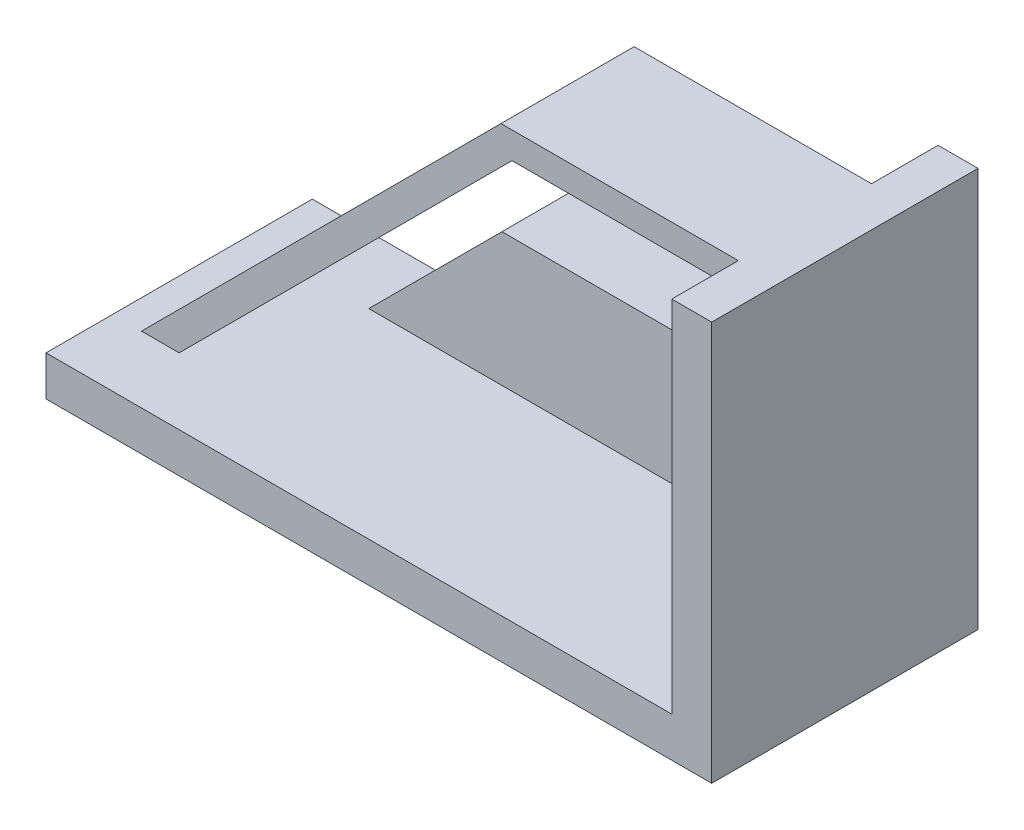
ISO-10303-21;
HEADER;
FILE_DESCRIPTION(('STEP AP214'),'2;1');
FILE_NAME('part.step','',(''),(''),'','','');
FILE_SCHEMA(('AUTOMOTIVE_DESIGN { 1 0 10303 214 1 1 1 1 }'));
ENDSEC;
DATA;
#1=APPLICATION_CONTEXT('core data for automotive mechanical design processes');
#2=APPLICATION_PROTOCOL_DEFINITION('international standard','automotive_design',2000,#1);
#3=PRODUCT_CONTEXT('',#1,'mechanical');
#4=PRODUCT('Part','Part','',(#3));
#5=PRODUCT_RELATED_PRODUCT_CATEGORY('part','',(#4));
#6=PRODUCT_DEFINITION_FORMATION('','',#4);
#7=PRODUCT_DEFINITION_CONTEXT('part definition',#1,'design');
#8=PRODUCT_DEFINITION('design','',#6,#7);
#9=PRODUCT_DEFINITION_SHAPE('','',#8);
#10=(LENGTH_UNIT() NAMED_UNIT(*) SI_UNIT(.MILLI.,.METRE.));
#11=(NAMED_UNIT(*) PLANE_ANGLE_UNIT() SI_UNIT($,.RADIAN.));
#12=(NAMED_UNIT(*) SI_UNIT($,.STERADIAN.) SOLID_ANGLE_UNIT());
#13=UNCERTAINTY_MEASURE_WITH_UNIT(LENGTH_MEASURE(1.E-05),#10,'distance_accuracy_value','');
#14=(GEOMETRIC_REPRESENTATION_CONTEXT(3) GLOBAL_UNCERTAINTY_ASSIGNED_CONTEXT((#13)) GLOBAL_UNIT_ASSIGNED_CONTEXT((#10,
#11,#12)) REPRESENTATION_CONTEXT('',''));
#15=CARTESIAN_POINT('',(0.,0.,0.));
#16=DIRECTION('',(0.,0.,1.));
#17=DIRECTION('',(1.,0.,0.));
#18=AXIS2_PLACEMENT_3D('',#15,#16,#17);
#19=CARTESIAN_POINT('',(47.,0.,10.));
#20=DIRECTION('',(-1.,0.,0.));
#21=DIRECTION('',(0.,0.,1.));
#22=AXIS2_PLACEMENT_3D('',#19,#20,#21);
#23=PLANE('',#22);
#24=DIRECTION('',(0.,1.,0.));
#25=VECTOR('',#24,1.);
#26=CARTESIAN_POINT('',(47.,30.,5.));
#27=LINE('',#26,#25);
#28=CARTESIAN_POINT('',(47.,28.,5.));
#29=VERTEX_POINT('',#28);
#30=CARTESIAN_POINT('',(47.,30.,5.));
#31=VERTEX_POINT('',#30);
#32=EDGE_CURVE('E194',#29,#31,#27,.T.);
#33=ORIENTED_EDGE('',*,*,#32,.F.);
#34=DIRECTION('',(0.,0.,-1.));
#35=VECTOR('',#34,1.);
#36=CARTESIAN_POINT('',(47.,28.,5.));
#37=LINE('',#36,#35);
#38=CARTESIAN_POINT('',(47.,28.,-5.));
#39=VERTEX_POINT('',#38);
#40=EDGE_CURVE('E207',#29,#39,#37,.T.);
#41=ORIENTED_EDGE('',*,*,#40,.T.);
#42=DIRECTION('',(0.,1.,0.));
#43=VECTOR('',#42,1.);
#44=CARTESIAN_POINT('',(47.,30.,-5.));
#45=LINE('',#44,#43);
#46=CARTESIAN_POINT('',(47.,30.,-5.));
#47=VERTEX_POINT('',#46);
#48=EDGE_CURVE('E169',#39,#47,#45,.T.);
#49=ORIENTED_EDGE('',*,*,#48,.T.);
#50=DIRECTION('',(0.,0.,-1.));
#51=VECTOR('',#50,1.);
#52=CARTESIAN_POINT('',(47.,30.,10.));
#53=LINE('',#52,#51);
#54=CARTESIAN_POINT('',(47.,30.,-10.));
#55=VERTEX_POINT('',#54);
#56=EDGE_CURVE('E263',#47,#55,#53,.T.);
#57=ORIENTED_EDGE('',*,*,#56,.T.);
#58=DIRECTION('',(0.,1.,0.));
#59=VECTOR('',#58,1.);
#60=CARTESIAN_POINT('',(47.,0.,-10.));
#61=LINE('',#60,#59);
#62=CARTESIAN_POINT('',(47.,3.,-10.));
#63=VERTEX_POINT('',#62);
#64=EDGE_CURVE('E228',#63,#55,#61,.T.);
#65=ORIENTED_EDGE('',*,*,#64,.F.);
#66=DIRECTION('',(0.,0.,-1.));
#67=VECTOR('',#66,1.);
#68=CARTESIAN_POINT('',(47.,3.,10.));
#69=LINE('',#68,#67);
#70=CARTESIAN_POINT('',(47.,3.,10.));
#71=VERTEX_POINT('',#70);
#72=EDGE_CURVE('E262',#71,#63,#69,.T.);
#73=ORIENTED_EDGE('',*,*,#72,.F.);
#74=DIRECTION('',(0.,1.,0.));
#75=VECTOR('',#74,1.);
#76=CARTESIAN_POINT('',(47.,0.,10.));
#77=LINE('',#76,#75);
#78=CARTESIAN_POINT('',(47.,30.,10.));
#79=VERTEX_POINT('',#78);
#80=EDGE_CURVE('E244',#71,#79,#77,.T.);
#81=ORIENTED_EDGE('',*,*,#80,.T.);
#82=EDGE_CURVE('E44',#79,#31,#53,.T.);
#83=ORIENTED_EDGE('',*,*,#82,.T.);
#84=EDGE_LOOP('',(#33,#41,#49,#57,#65,#73,#81,#83));
#85=FACE_BOUND('',#84,.T.);
#86=DIRECTION('',(0.,0.,1.));
#87=VECTOR('',#86,1.);
#88=CARTESIAN_POINT('',(47.,13.,-5.));
#89=LINE('',#88,#87);
#90=CARTESIAN_POINT('',(47.,13.,-5.));
#91=VERTEX_POINT('',#90);
#92=CARTESIAN_POINT('',(47.,13.,5.));
#93=VERTEX_POINT('',#92);
#94=EDGE_CURVE('E180',#91,#93,#89,.T.);
#95=ORIENTED_EDGE('',*,*,#94,.F.);
#96=DIRECTION('',(0.,-1.,0.));
#97=VECTOR('',#96,1.);
#98=CARTESIAN_POINT('',(47.,23.,-5.));
#99=LINE('',#98,#97);
#100=CARTESIAN_POINT('',(47.,23.,-5.));
#101=VERTEX_POINT('',#100);
#102=EDGE_CURVE('E174',#101,#91,#99,.T.);
#103=ORIENTED_EDGE('',*,*,#102,.F.);
#104=DIRECTION('',(0.,0.,-1.));
#105=VECTOR('',#104,1.);
#106=CARTESIAN_POINT('',(47.,23.,-5.));
#107=LINE('',#106,#105);
#108=CARTESIAN_POINT('',(47.,23.,5.));
#109=VERTEX_POINT('',#108);
#110=EDGE_CURVE('E155',#109,#101,#107,.T.);
#111=ORIENTED_EDGE('',*,*,#110,.F.);
#112=DIRECTION('',(0.,1.,0.));
#113=VECTOR('',#112,1.);
#114=CARTESIAN_POINT('',(47.,23.,5.));
#115=LINE('',#114,#113);
#116=EDGE_CURVE('E51',#93,#109,#115,.T.);
#117=ORIENTED_EDGE('',*,*,#116,.F.);
#118=EDGE_LOOP('',(#95,#103,#111,#117));
#119=FACE_BOUND('',#118,.T.);
#120=ADVANCED_FACE('F36',(#85,#119),#23,.T.);
#121=CARTESIAN_POINT('',(50.,0.,10.));
#122=DIRECTION('',(-1.,0.,0.));
#123=DIRECTION('',(0.,0.,1.));
#124=AXIS2_PLACEMENT_3D('',#121,#122,#123);
#125=PLANE('',#124);
#126=DIRECTION('',(0.,1.,0.));
#127=VECTOR('',#126,1.);
#128=CARTESIAN_POINT('',(50.,0.,-10.));
#129=LINE('',#128,#127);
#130=CARTESIAN_POINT('',(50.,0.,-10.));
#131=VERTEX_POINT('',#130);
#132=CARTESIAN_POINT('',(50.,30.,-10.));
#133=VERTEX_POINT('',#132);
#134=EDGE_CURVE('E222',#131,#133,#129,.T.);
#135=ORIENTED_EDGE('',*,*,#134,.T.);
#136=DIRECTION('',(0.,0.,-1.));
#137=VECTOR('',#136,1.);
#138=CARTESIAN_POINT('',(50.,30.,10.));
#139=LINE('',#138,#137);
#140=CARTESIAN_POINT('',(50.,30.,10.));
#141=VERTEX_POINT('',#140);
#142=EDGE_CURVE('E13',#141,#133,#139,.T.);
#143=ORIENTED_EDGE('',*,*,#142,.F.);
#144=DIRECTION('',(0.,1.,0.));
#145=VECTOR('',#144,1.);
#146=CARTESIAN_POINT('',(50.,0.,10.));
#147=LINE('',#146,#145);
#148=CARTESIAN_POINT('',(50.,0.,10.));
#149=VERTEX_POINT('',#148);
#150=EDGE_CURVE('E239',#149,#141,#147,.T.);
#151=ORIENTED_EDGE('',*,*,#150,.F.);
#152=DIRECTION('',(0.,0.,-1.));
#153=VECTOR('',#152,1.);
#154=CARTESIAN_POINT('',(50.,0.,10.));
#155=LINE('',#154,#153);
#156=EDGE_CURVE('E255',#149,#131,#155,.T.);
#157=ORIENTED_EDGE('',*,*,#156,.T.);
#158=EDGE_LOOP('',(#135,#143,#151,#157));
#159=FACE_BOUND('',#158,.T.);
#160=ADVANCED_FACE('F38',(#159),#125,.F.);
#161=CARTESIAN_POINT('',(47.,30.,10.));
#162=DIRECTION('',(0.,1.,0.));
#163=DIRECTION('',(0.,0.,1.));
#164=AXIS2_PLACEMENT_3D('',#161,#162,#163);
#165=PLANE('',#164);
#166=DIRECTION('',(1.,0.,0.));
#167=VECTOR('',#166,1.);
#168=CARTESIAN_POINT('',(47.,30.,-10.));
#169=LINE('',#168,#167);
#170=EDGE_CURVE('E225',#55,#133,#169,.T.);
#171=ORIENTED_EDGE('',*,*,#170,.F.);
#172=ORIENTED_EDGE('',*,*,#56,.F.);
#173=DIRECTION('',(-1.,0.,0.));
#174=VECTOR('',#173,1.);
#175=CARTESIAN_POINT('',(47.,30.,-5.));
#176=LINE('',#175,#174);
#177=CARTESIAN_POINT('',(29.1715728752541,30.,-5.));
#178=VERTEX_POINT('',#177);
#179=EDGE_CURVE('E59',#47,#178,#176,.T.);
#180=ORIENTED_EDGE('',*,*,#179,.T.);
#181=DIRECTION('',(0.,0.,-1.));
#182=VECTOR('',#181,1.);
#183=CARTESIAN_POINT('',(29.1715728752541,30.,5.));
#184=LINE('',#183,#182);
#185=CARTESIAN_POINT('',(29.1715728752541,30.,5.));
#186=VERTEX_POINT('',#185);
#187=EDGE_CURVE('E219',#186,#178,#184,.T.);
#188=ORIENTED_EDGE('',*,*,#187,.F.);
#189=DIRECTION('',(-1.,0.,0.));
#190=VECTOR('',#189,1.);
#191=CARTESIAN_POINT('',(47.,30.,5.));
#192=LINE('',#191,#190);
#193=EDGE_CURVE('E197',#31,#186,#192,.T.);
#194=ORIENTED_EDGE('',*,*,#193,.F.);
#195=ORIENTED_EDGE('',*,*,#82,.F.);
#196=DIRECTION('',(1.,0.,0.));
#197=VECTOR('',#196,1.);
#198=CARTESIAN_POINT('',(47.,30.,10.));
#199=LINE('',#198,#197);
#200=EDGE_CURVE('E241',#79,#141,#199,.T.);
#201=ORIENTED_EDGE('',*,*,#200,.T.);
#202=ORIENTED_EDGE('',*,*,#142,.T.);
#203=EDGE_LOOP('',(#171,#172,#180,#188,#194,#195,#201,#202));
#204=FACE_BOUND('',#203,.T.);
#205=ADVANCED_FACE('F272',(#204),#165,.T.);
#206=CARTESIAN_POINT('',(0.,3.,10.));
#207=DIRECTION('',(0.,1.,0.));
#208=DIRECTION('',(0.,0.,1.));
#209=AXIS2_PLACEMENT_3D('',#206,#207,#208);
#210=PLANE('',#209);
#211=DIRECTION('',(1.,0.,0.));
#212=VECTOR('',#211,1.);
#213=CARTESIAN_POINT('',(2.1715728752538,3.,5.));
#214=LINE('',#213,#212);
#215=CARTESIAN_POINT('',(2.1715728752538,3.,5.));
#216=VERTEX_POINT('',#215);
#217=CARTESIAN_POINT('',(5.,3.,5.));
#218=VERTEX_POINT('',#217);
#219=EDGE_CURVE('E201',#216,#218,#214,.T.);
#220=ORIENTED_EDGE('',*,*,#219,.F.);
#221=DIRECTION('',(0.,0.,-1.));
#222=VECTOR('',#221,1.);
#223=CARTESIAN_POINT('',(2.1715728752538,3.,5.));
#224=LINE('',#223,#222);
#225=CARTESIAN_POINT('',(2.1715728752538,3.,-5.));
#226=VERTEX_POINT('',#225);
#227=EDGE_CURVE('E216',#216,#226,#224,.T.);
#228=ORIENTED_EDGE('',*,*,#227,.T.);
#229=DIRECTION('',(1.,0.,0.));
#230=VECTOR('',#229,1.);
#231=CARTESIAN_POINT('',(2.1715728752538,3.,-5.));
#232=LINE('',#231,#230);
#233=CARTESIAN_POINT('',(5.,3.,-5.));
#234=VERTEX_POINT('',#233);
#235=EDGE_CURVE('E187',#226,#234,#232,.T.);
#236=ORIENTED_EDGE('',*,*,#235,.T.);
#237=DIRECTION('',(0.,0.,-1.));
#238=VECTOR('',#237,1.);
#239=CARTESIAN_POINT('',(5.,3.,5.));
#240=LINE('',#239,#238);
#241=EDGE_CURVE('E213',#218,#234,#240,.T.);
#242=ORIENTED_EDGE('',*,*,#241,.F.);
#243=EDGE_LOOP('',(#220,#228,#236,#242));
#244=FACE_BOUND('',#243,.T.);
#245=DIRECTION('',(1.,0.,0.));
#246=VECTOR('',#245,1.);
#247=CARTESIAN_POINT('',(0.,3.,-10.));
#248=LINE('',#247,#246);
#249=CARTESIAN_POINT('',(0.,3.,-10.));
#250=VERTEX_POINT('',#249);
#251=EDGE_CURVE('E231',#250,#63,#248,.T.);
#252=ORIENTED_EDGE('',*,*,#251,.F.);
#253=DIRECTION('',(0.,0.,-1.));
#254=VECTOR('',#253,1.);
#255=CARTESIAN_POINT('',(0.,3.,10.));
#256=LINE('',#255,#254);
#257=CARTESIAN_POINT('',(0.,3.,10.));
#258=VERTEX_POINT('',#257);
#259=EDGE_CURVE('E260',#258,#250,#256,.T.);
#260=ORIENTED_EDGE('',*,*,#259,.F.);
#261=DIRECTION('',(1.,0.,0.));
#262=VECTOR('',#261,1.);
#263=CARTESIAN_POINT('',(0.,3.,10.));
#264=LINE('',#263,#262);
#265=EDGE_CURVE('E247',#258,#71,#264,.T.);
#266=ORIENTED_EDGE('',*,*,#265,.T.);
#267=ORIENTED_EDGE('',*,*,#72,.T.);
#268=EDGE_LOOP('',(#252,#260,#266,#267));
#269=FACE_BOUND('',#268,.T.);
#270=ADVANCED_FACE('F281',(#244,#269),#210,.T.);
#271=CARTESIAN_POINT('',(0.,0.,10.));
#272=DIRECTION('',(-1.,0.,0.));
#273=DIRECTION('',(0.,0.,1.));
#274=AXIS2_PLACEMENT_3D('',#271,#272,#273);
#275=PLANE('',#274);
#276=DIRECTION('',(0.,1.,0.));
#277=VECTOR('',#276,1.);
#278=CARTESIAN_POINT('',(0.,0.,-10.));
#279=LINE('',#278,#277);
#280=CARTESIAN_POINT('',(0.,0.,-10.));
#281=VERTEX_POINT('',#280);
#282=EDGE_CURVE('E234',#281,#250,#279,.T.);
#283=ORIENTED_EDGE('',*,*,#282,.F.);
#284=DIRECTION('',(0.,0.,-1.));
#285=VECTOR('',#284,1.);
#286=CARTESIAN_POINT('',(0.,0.,10.));
#287=LINE('',#286,#285);
#288=CARTESIAN_POINT('',(0.,0.,10.));
#289=VERTEX_POINT('',#288);
#290=EDGE_CURVE('E258',#289,#281,#287,.T.);
#291=ORIENTED_EDGE('',*,*,#290,.F.);
#292=DIRECTION('',(0.,1.,0.));
#293=VECTOR('',#292,1.);
#294=CARTESIAN_POINT('',(0.,0.,10.));
#295=LINE('',#294,#293);
#296=EDGE_CURVE('E250',#289,#258,#295,.T.);
#297=ORIENTED_EDGE('',*,*,#296,.T.);
#298=ORIENTED_EDGE('',*,*,#259,.T.);
#299=EDGE_LOOP('',(#283,#291,#297,#298));
#300=FACE_BOUND('',#299,.T.);
#301=ADVANCED_FACE('F324',(#300),#275,.T.);
#302=CARTESIAN_POINT('',(0.,0.,10.));
#303=DIRECTION('',(0.,1.,0.));
#304=DIRECTION('',(0.,0.,1.));
#305=AXIS2_PLACEMENT_3D('',#302,#303,#304);
#306=PLANE('',#305);
#307=DIRECTION('',(1.,0.,0.));
#308=VECTOR('',#307,1.);
#309=CARTESIAN_POINT('',(0.,0.,-10.));
#310=LINE('',#309,#308);
#311=EDGE_CURVE('E237',#281,#131,#310,.T.);
#312=ORIENTED_EDGE('',*,*,#311,.T.);
#313=ORIENTED_EDGE('',*,*,#156,.F.);
#314=DIRECTION('',(1.,0.,0.));
#315=VECTOR('',#314,1.);
#316=CARTESIAN_POINT('',(0.,0.,10.));
#317=LINE('',#316,#315);
#318=EDGE_CURVE('E253',#289,#149,#317,.T.);
#319=ORIENTED_EDGE('',*,*,#318,.F.);
#320=ORIENTED_EDGE('',*,*,#290,.T.);
#321=EDGE_LOOP('',(#312,#313,#319,#320));
#322=FACE_BOUND('',#321,.T.);
#323=ADVANCED_FACE('F329',(#322),#306,.F.);
#324=CARTESIAN_POINT('',(50.,30.,10.));
#325=DIRECTION('',(0.,0.,-1.));
#326=DIRECTION('',(-1.,0.,0.));
#327=AXIS2_PLACEMENT_3D('',#324,#325,#326);
#328=PLANE('',#327);
#329=ORIENTED_EDGE('',*,*,#150,.T.);
#330=ORIENTED_EDGE('',*,*,#200,.F.);
#331=ORIENTED_EDGE('',*,*,#80,.F.);
#332=ORIENTED_EDGE('',*,*,#265,.F.);
#333=ORIENTED_EDGE('',*,*,#296,.F.);
#334=ORIENTED_EDGE('',*,*,#318,.T.);
#335=EDGE_LOOP('',(#329,#330,#331,#332,#333,#334));
#336=FACE_BOUND('',#335,.T.);
#337=ADVANCED_FACE('F286',(#336),#328,.F.);
#338=CARTESIAN_POINT('',(50.,30.,-10.));
#339=DIRECTION('',(0.,0.,-1.));
#340=DIRECTION('',(-1.,0.,0.));
#341=AXIS2_PLACEMENT_3D('',#338,#339,#340);
#342=PLANE('',#341);
#343=ORIENTED_EDGE('',*,*,#134,.F.);
#344=ORIENTED_EDGE('',*,*,#311,.F.);
#345=ORIENTED_EDGE('',*,*,#282,.T.);
#346=ORIENTED_EDGE('',*,*,#251,.T.);
#347=ORIENTED_EDGE('',*,*,#64,.T.);
#348=ORIENTED_EDGE('',*,*,#170,.T.);
#349=EDGE_LOOP('',(#343,#344,#345,#346,#347,#348));
#350=FACE_BOUND('',#349,.T.);
#351=ADVANCED_FACE('F276',(#350),#342,.T.);
#352=CARTESIAN_POINT('',(29.1715728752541,30.,5.));
#353=DIRECTION('',(0.707106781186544,-0.707106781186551,0.));
#354=DIRECTION('',(0.707106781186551,0.707106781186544,0.));
#355=AXIS2_PLACEMENT_3D('',#352,#353,#354);
#356=PLANE('',#355);
#357=DIRECTION('',(-0.707106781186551,-0.707106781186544,0.));
#358=VECTOR('',#357,1.);
#359=CARTESIAN_POINT('',(29.1715728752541,30.,-5.));
#360=LINE('',#359,#358);
#361=EDGE_CURVE('E185',#178,#226,#360,.T.);
#362=ORIENTED_EDGE('',*,*,#361,.T.);
#363=ORIENTED_EDGE('',*,*,#227,.F.);
#364=DIRECTION('',(-0.707106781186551,-0.707106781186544,0.));
#365=VECTOR('',#364,1.);
#366=CARTESIAN_POINT('',(29.1715728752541,30.,5.));
#367=LINE('',#366,#365);
#368=EDGE_CURVE('E199',#186,#216,#367,.T.);
#369=ORIENTED_EDGE('',*,*,#368,.F.);
#370=ORIENTED_EDGE('',*,*,#187,.T.);
#371=EDGE_LOOP('',(#362,#363,#369,#370));
#372=FACE_BOUND('',#371,.T.);
#373=ADVANCED_FACE('F339',(#372),#356,.F.);
#374=CARTESIAN_POINT('',(30.0000000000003,28.,5.));
#375=DIRECTION('',(-0.707106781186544,0.707106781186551,0.));
#376=DIRECTION('',(-0.707106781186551,-0.707106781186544,0.));
#377=AXIS2_PLACEMENT_3D('',#374,#375,#376);
#378=PLANE('',#377);
#379=DIRECTION('',(0.707106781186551,0.707106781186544,0.));
#380=VECTOR('',#379,1.);
#381=CARTESIAN_POINT('',(30.0000000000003,28.,-5.));
#382=LINE('',#381,#380);
#383=CARTESIAN_POINT('',(30.0000000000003,28.,-5.));
#384=VERTEX_POINT('',#383);
#385=EDGE_CURVE('E190',#234,#384,#382,.T.);
#386=ORIENTED_EDGE('',*,*,#385,.T.);
#387=DIRECTION('',(0.,0.,-1.));
#388=VECTOR('',#387,1.);
#389=CARTESIAN_POINT('',(30.0000000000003,28.,5.));
#390=LINE('',#389,#388);
#391=CARTESIAN_POINT('',(30.0000000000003,28.,5.));
#392=VERTEX_POINT('',#391);
#393=EDGE_CURVE('E210',#392,#384,#390,.T.);
#394=ORIENTED_EDGE('',*,*,#393,.F.);
#395=DIRECTION('',(0.707106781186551,0.707106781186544,0.));
#396=VECTOR('',#395,1.);
#397=CARTESIAN_POINT('',(30.0000000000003,28.,5.));
#398=LINE('',#397,#396);
#399=EDGE_CURVE('E203',#218,#392,#398,.T.);
#400=ORIENTED_EDGE('',*,*,#399,.F.);
#401=ORIENTED_EDGE('',*,*,#241,.T.);
#402=EDGE_LOOP('',(#386,#394,#400,#401));
#403=FACE_BOUND('',#402,.T.);
#404=ADVANCED_FACE('F336',(#403),#378,.F.);
#405=CARTESIAN_POINT('',(47.,28.,5.));
#406=DIRECTION('',(0.,1.,0.));
#407=DIRECTION('',(-1.,0.,0.));
#408=AXIS2_PLACEMENT_3D('',#405,#406,#407);
#409=PLANE('',#408);
#410=DIRECTION('',(1.,0.,0.));
#411=VECTOR('',#410,1.);
#412=CARTESIAN_POINT('',(47.,28.,-5.));
#413=LINE('',#412,#411);
#414=EDGE_CURVE('E192',#384,#39,#413,.T.);
#415=ORIENTED_EDGE('',*,*,#414,.T.);
#416=ORIENTED_EDGE('',*,*,#40,.F.);
#417=DIRECTION('',(1.,0.,0.));
#418=VECTOR('',#417,1.);
#419=CARTESIAN_POINT('',(47.,28.,5.));
#420=LINE('',#419,#418);
#421=EDGE_CURVE('E205',#392,#29,#420,.T.);
#422=ORIENTED_EDGE('',*,*,#421,.F.);
#423=ORIENTED_EDGE('',*,*,#393,.T.);
#424=EDGE_LOOP('',(#415,#416,#422,#423));
#425=FACE_BOUND('',#424,.T.);
#426=ADVANCED_FACE('F296',(#425),#409,.F.);
#427=CARTESIAN_POINT('',(47.,3.,5.));
#428=DIRECTION('',(0.,0.,1.));
#429=DIRECTION('',(1.,0.,0.));
#430=AXIS2_PLACEMENT_3D('',#427,#428,#429);
#431=PLANE('',#430);
#432=ORIENTED_EDGE('',*,*,#32,.T.);
#433=ORIENTED_EDGE('',*,*,#193,.T.);
#434=ORIENTED_EDGE('',*,*,#368,.T.);
#435=ORIENTED_EDGE('',*,*,#219,.T.);
#436=ORIENTED_EDGE('',*,*,#399,.T.);
#437=ORIENTED_EDGE('',*,*,#421,.T.);
#438=EDGE_LOOP('',(#432,#433,#434,#435,#436,#437));
#439=FACE_BOUND('',#438,.T.);
#440=ADVANCED_FACE('F292',(#439),#431,.T.);
#441=CARTESIAN_POINT('',(47.,3.,-5.));
#442=DIRECTION('',(0.,0.,1.));
#443=DIRECTION('',(1.,0.,0.));
#444=AXIS2_PLACEMENT_3D('',#441,#442,#443);
#445=PLANE('',#444);
#446=ORIENTED_EDGE('',*,*,#48,.F.);
#447=ORIENTED_EDGE('',*,*,#414,.F.);
#448=ORIENTED_EDGE('',*,*,#385,.F.);
#449=ORIENTED_EDGE('',*,*,#235,.F.);
#450=ORIENTED_EDGE('',*,*,#361,.F.);
#451=ORIENTED_EDGE('',*,*,#179,.F.);
#452=EDGE_LOOP('',(#446,#447,#448,#449,#450,#451));
#453=FACE_BOUND('',#452,.T.);
#454=ADVANCED_FACE('F299',(#453),#445,.F.);
#455=CARTESIAN_POINT('',(4.17157287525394,23.,-5.));
#456=DIRECTION('',(0.,0.,1.));
#457=DIRECTION('',(0.,-1.,0.));
#458=AXIS2_PLACEMENT_3D('',#455,#456,#457);
#459=PLANE('',#458);
#460=DIRECTION('',(-0.707106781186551,-0.707106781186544,0.));
#461=VECTOR('',#460,1.);
#462=CARTESIAN_POINT('',(16.7071067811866,10.4644660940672,-5.));
#463=LINE('',#462,#461);
#464=CARTESIAN_POINT('',(29.2426406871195,23.,-5.));
#465=VERTEX_POINT('',#464);
#466=CARTESIAN_POINT('',(19.2426406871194,13.,-5.));
#467=VERTEX_POINT('',#466);
#468=EDGE_CURVE('E164',#465,#467,#463,.T.);
#469=ORIENTED_EDGE('',*,*,#468,.F.);
#470=DIRECTION('',(1.,0.,0.));
#471=VECTOR('',#470,1.);
#472=CARTESIAN_POINT('',(4.17157287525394,23.,-5.));
#473=LINE('',#472,#471);
#474=EDGE_CURVE('E160',#465,#101,#473,.T.);
#475=ORIENTED_EDGE('',*,*,#474,.T.);
#476=ORIENTED_EDGE('',*,*,#102,.T.);
#477=DIRECTION('',(1.,0.,0.));
#478=VECTOR('',#477,1.);
#479=CARTESIAN_POINT('',(4.17157287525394,13.,-5.));
#480=LINE('',#479,#478);
#481=EDGE_CURVE('E178',#467,#91,#480,.T.);
#482=ORIENTED_EDGE('',*,*,#481,.F.);
#483=EDGE_LOOP('',(#469,#475,#476,#482));
#484=FACE_BOUND('',#483,.T.);
#485=ADVANCED_FACE('F301',(#484),#459,.F.);
#486=CARTESIAN_POINT('',(4.17157287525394,13.,-5.));
#487=DIRECTION('',(0.,1.,0.));
#488=DIRECTION('',(0.,0.,1.));
#489=AXIS2_PLACEMENT_3D('',#486,#487,#488);
#490=PLANE('',#489);
#491=DIRECTION('',(0.,0.,1.));
#492=VECTOR('',#491,1.);
#493=CARTESIAN_POINT('',(19.2426406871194,13.,-5.));
#494=LINE('',#493,#492);
#495=CARTESIAN_POINT('',(19.2426406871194,13.,5.));
#496=VERTEX_POINT('',#495);
#497=EDGE_CURVE('E168',#467,#496,#494,.T.);
#498=ORIENTED_EDGE('',*,*,#497,.F.);
#499=ORIENTED_EDGE('',*,*,#481,.T.);
#500=ORIENTED_EDGE('',*,*,#94,.T.);
#501=DIRECTION('',(1.,0.,0.));
#502=VECTOR('',#501,1.);
#503=CARTESIAN_POINT('',(4.17157287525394,13.,5.));
#504=LINE('',#503,#502);
#505=EDGE_CURVE('E181',#496,#93,#504,.T.);
#506=ORIENTED_EDGE('',*,*,#505,.F.);
#507=EDGE_LOOP('',(#498,#499,#500,#506));
#508=FACE_BOUND('',#507,.T.);
#509=ADVANCED_FACE('F307',(#508),#490,.F.);
#510=CARTESIAN_POINT('',(4.17157287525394,23.,5.));
#511=DIRECTION('',(0.,0.,-1.));
#512=DIRECTION('',(-1.,0.,0.));
#513=AXIS2_PLACEMENT_3D('',#510,#511,#512);
#514=PLANE('',#513);
#515=DIRECTION('',(0.707106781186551,0.707106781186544,0.));
#516=VECTOR('',#515,1.);
#517=CARTESIAN_POINT('',(16.7071067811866,10.4644660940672,5.));
#518=LINE('',#517,#516);
#519=CARTESIAN_POINT('',(29.2426406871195,23.,5.));
#520=VERTEX_POINT('',#519);
#521=EDGE_CURVE('E150',#496,#520,#518,.T.);
#522=ORIENTED_EDGE('',*,*,#521,.F.);
#523=ORIENTED_EDGE('',*,*,#505,.T.);
#524=ORIENTED_EDGE('',*,*,#116,.T.);
#525=DIRECTION('',(1.,0.,0.));
#526=VECTOR('',#525,1.);
#527=CARTESIAN_POINT('',(4.17157287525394,23.,5.));
#528=LINE('',#527,#526);
#529=EDGE_CURVE('E146',#520,#109,#528,.T.);
#530=ORIENTED_EDGE('',*,*,#529,.F.);
#531=EDGE_LOOP('',(#522,#523,#524,#530));
#532=FACE_BOUND('',#531,.T.);
#533=ADVANCED_FACE('F148',(#532),#514,.F.);
#534=CARTESIAN_POINT('',(4.17157287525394,23.,-5.));
#535=DIRECTION('',(0.,-1.,0.));
#536=DIRECTION('',(0.,0.,-1.));
#537=AXIS2_PLACEMENT_3D('',#534,#535,#536);
#538=PLANE('',#537);
#539=DIRECTION('',(0.,0.,-1.));
#540=VECTOR('',#539,1.);
#541=CARTESIAN_POINT('',(29.2426406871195,23.,-5.));
#542=LINE('',#541,#540);
#543=EDGE_CURVE('E158',#520,#465,#542,.T.);
#544=ORIENTED_EDGE('',*,*,#543,.F.);
#545=ORIENTED_EDGE('',*,*,#529,.T.);
#546=ORIENTED_EDGE('',*,*,#110,.T.);
#547=ORIENTED_EDGE('',*,*,#474,.F.);
#548=EDGE_LOOP('',(#544,#545,#546,#547));
#549=FACE_BOUND('',#548,.T.);
#550=ADVANCED_FACE('F159',(#549),#538,.F.);
#551=CARTESIAN_POINT('',(32.1213203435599,25.8786796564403,5.));
#552=DIRECTION('',(-0.707106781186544,0.707106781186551,0.));
#553=DIRECTION('',(-0.707106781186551,-0.707106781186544,0.));
#554=AXIS2_PLACEMENT_3D('',#551,#552,#553);
#555=PLANE('',#554);
#556=ORIENTED_EDGE('',*,*,#543,.T.);
#557=ORIENTED_EDGE('',*,*,#468,.T.);
#558=ORIENTED_EDGE('',*,*,#497,.T.);
#559=ORIENTED_EDGE('',*,*,#521,.T.);
#560=EDGE_LOOP('',(#556,#557,#558,#559));
#561=FACE_BOUND('',#560,.T.);
#562=ADVANCED_FACE('F167',(#561),#555,.T.);
#563=CLOSED_SHELL('',(#120,#160,#205,#270,#301,#323,#337,#351,#373,#404,#426,#440,#454,#485,
#509,#533,#550,#562));
#564=MANIFOLD_SOLID_BREP('B2',#563);
#565=ADVANCED_BREP_SHAPE_REPRESENTATION('',(#18,#564),#14);
#566=SHAPE_DEFINITION_REPRESENTATION(#9,#565);
ENDSEC;
END-ISO-10303-21;
